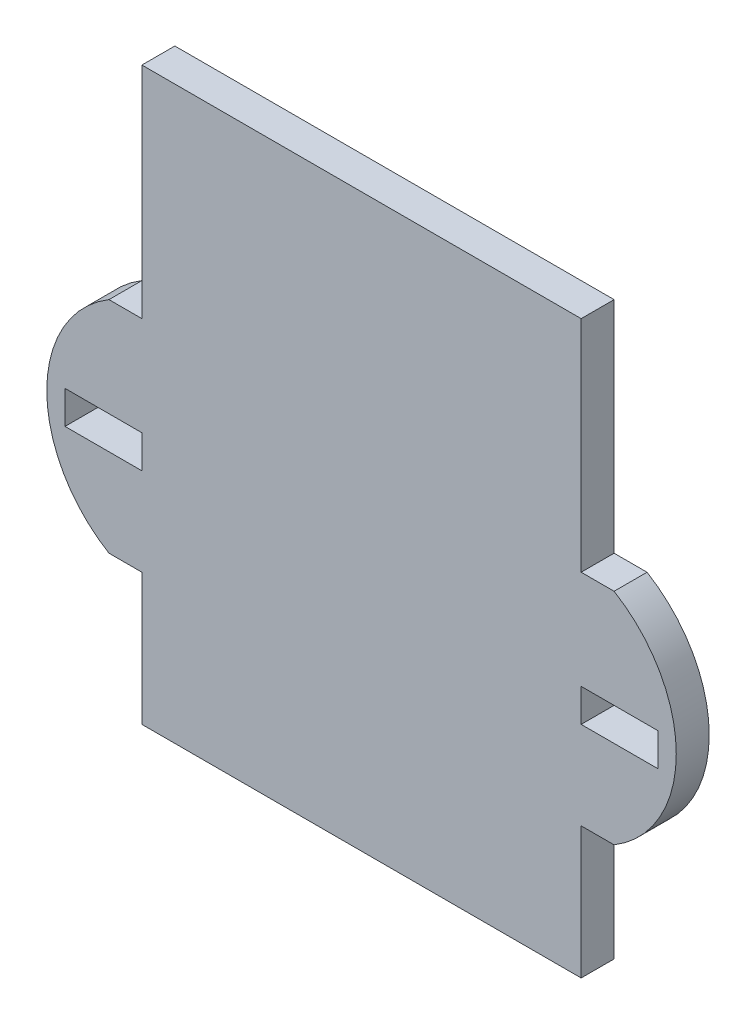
ISO-10303-21;
HEADER;
FILE_DESCRIPTION(('STEP AP214'),'2;1');
FILE_NAME('part.step','',(''),(''),'','','');
FILE_SCHEMA(('AUTOMOTIVE_DESIGN { 1 0 10303 214 1 1 1 1 }'));
ENDSEC;
DATA;
#1=APPLICATION_CONTEXT('core data for automotive mechanical design processes');
#2=APPLICATION_PROTOCOL_DEFINITION('international standard','automotive_design',2000,#1);
#3=PRODUCT_CONTEXT('',#1,'mechanical');
#4=PRODUCT('Part','Part','',(#3));
#5=PRODUCT_RELATED_PRODUCT_CATEGORY('part','',(#4));
#6=PRODUCT_DEFINITION_FORMATION('','',#4);
#7=PRODUCT_DEFINITION_CONTEXT('part definition',#1,'design');
#8=PRODUCT_DEFINITION('design','',#6,#7);
#9=PRODUCT_DEFINITION_SHAPE('','',#8);
#10=(LENGTH_UNIT() NAMED_UNIT(*) SI_UNIT(.MILLI.,.METRE.));
#11=(NAMED_UNIT(*) PLANE_ANGLE_UNIT() SI_UNIT($,.RADIAN.));
#12=(NAMED_UNIT(*) SI_UNIT($,.STERADIAN.) SOLID_ANGLE_UNIT());
#13=UNCERTAINTY_MEASURE_WITH_UNIT(LENGTH_MEASURE(1.E-05),#10,'distance_accuracy_value','');
#14=(GEOMETRIC_REPRESENTATION_CONTEXT(3) GLOBAL_UNCERTAINTY_ASSIGNED_CONTEXT((#13)) GLOBAL_UNIT_ASSIGNED_CONTEXT((#10,
#11,#12)) REPRESENTATION_CONTEXT('',''));
#15=CARTESIAN_POINT('',(0.,0.,0.));
#16=DIRECTION('',(0.,0.,1.));
#17=DIRECTION('',(1.,0.,0.));
#18=AXIS2_PLACEMENT_3D('',#15,#16,#17);
#19=CARTESIAN_POINT('',(-15.6140047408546,10.,3.));
#20=DIRECTION('',(0.,0.,-1.));
#21=DIRECTION('',(-1.,0.,0.));
#22=AXIS2_PLACEMENT_3D('',#19,#20,#21);
#23=PLANE('',#22);
#24=DIRECTION('',(0.,-1.,0.));
#25=VECTOR('',#24,1.);
#26=CARTESIAN_POINT('',(21.3859952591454,11.,3.));
#27=LINE('',#26,#25);
#28=CARTESIAN_POINT('',(21.3859952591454,11.,3.));
#29=VERTEX_POINT('',#28);
#30=CARTESIAN_POINT('',(21.3859952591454,8.00000000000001,3.));
#31=VERTEX_POINT('',#30);
#32=EDGE_CURVE('E206',#29,#31,#27,.T.);
#33=ORIENTED_EDGE('',*,*,#32,.F.);
#34=DIRECTION('',(-1.,0.,0.));
#35=VECTOR('',#34,1.);
#36=CARTESIAN_POINT('',(21.3859952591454,11.,3.));
#37=LINE('',#36,#35);
#38=CARTESIAN_POINT('',(28.3859952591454,11.,3.));
#39=VERTEX_POINT('',#38);
#40=EDGE_CURVE('E214',#39,#29,#37,.T.);
#41=ORIENTED_EDGE('',*,*,#40,.F.);
#42=DIRECTION('',(0.,1.,0.));
#43=VECTOR('',#42,1.);
#44=CARTESIAN_POINT('',(28.3859952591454,11.,3.));
#45=LINE('',#44,#43);
#46=CARTESIAN_POINT('',(28.3859952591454,8.00000000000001,3.));
#47=VERTEX_POINT('',#46);
#48=EDGE_CURVE('E211',#47,#39,#45,.T.);
#49=ORIENTED_EDGE('',*,*,#48,.F.);
#50=DIRECTION('',(1.,0.,0.));
#51=VECTOR('',#50,1.);
#52=CARTESIAN_POINT('',(21.3859952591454,8.00000000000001,3.));
#53=LINE('',#52,#51);
#54=EDGE_CURVE('E208',#31,#47,#53,.T.);
#55=ORIENTED_EDGE('',*,*,#54,.F.);
#56=EDGE_LOOP('',(#33,#41,#49,#55));
#57=FACE_BOUND('',#56,.T.);
#58=DIRECTION('',(0.,-1.,0.));
#59=VECTOR('',#58,1.);
#60=CARTESIAN_POINT('',(-18.6140047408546,40.,3.));
#61=LINE('',#60,#59);
#62=CARTESIAN_POINT('',(-18.6140047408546,40.,3.));
#63=VERTEX_POINT('',#62);
#64=CARTESIAN_POINT('',(-18.6140047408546,20.,3.));
#65=VERTEX_POINT('',#64);
#66=EDGE_CURVE('E237',#63,#65,#61,.T.);
#67=ORIENTED_EDGE('',*,*,#66,.T.);
#68=DIRECTION('',(-1.,0.,0.));
#69=VECTOR('',#68,1.);
#70=CARTESIAN_POINT('',(-21.6140047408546,20.,3.));
#71=LINE('',#70,#69);
#72=CARTESIAN_POINT('',(-21.6140047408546,20.,3.));
#73=VERTEX_POINT('',#72);
#74=EDGE_CURVE('E240',#65,#73,#71,.T.);
#75=ORIENTED_EDGE('',*,*,#74,.T.);
#76=CARTESIAN_POINT('',(-15.6140047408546,10.,3.));
#77=DIRECTION('',(0.,0.,1.));
#78=DIRECTION('',(-1.,0.,0.));
#79=AXIS2_PLACEMENT_3D('',#76,#77,#78);
#80=CIRCLE('',#79,11.6619037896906);
#81=CARTESIAN_POINT('',(-21.6140047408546,0.,3.));
#82=VERTEX_POINT('',#81);
#83=EDGE_CURVE('E243',#73,#82,#80,.T.);
#84=ORIENTED_EDGE('',*,*,#83,.T.);
#85=DIRECTION('',(1.,0.,0.));
#86=VECTOR('',#85,1.);
#87=CARTESIAN_POINT('',(-18.6140047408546,0.,3.));
#88=LINE('',#87,#86);
#89=CARTESIAN_POINT('',(-18.6140047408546,0.,3.));
#90=VERTEX_POINT('',#89);
#91=EDGE_CURVE('E245',#82,#90,#88,.T.);
#92=ORIENTED_EDGE('',*,*,#91,.T.);
#93=DIRECTION('',(0.,-1.,0.));
#94=VECTOR('',#93,1.);
#95=CARTESIAN_POINT('',(-18.6140047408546,0.,3.));
#96=LINE('',#95,#94);
#97=CARTESIAN_POINT('',(-18.6140047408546,-12.,3.));
#98=VERTEX_POINT('',#97);
#99=EDGE_CURVE('E247',#90,#98,#96,.T.);
#100=ORIENTED_EDGE('',*,*,#99,.T.);
#101=DIRECTION('',(1.,0.,0.));
#102=VECTOR('',#101,1.);
#103=CARTESIAN_POINT('',(-18.6140047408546,-12.,3.));
#104=LINE('',#103,#102);
#105=CARTESIAN_POINT('',(21.3859952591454,-12.,3.));
#106=VERTEX_POINT('',#105);
#107=EDGE_CURVE('E249',#98,#106,#104,.T.);
#108=ORIENTED_EDGE('',*,*,#107,.T.);
#109=DIRECTION('',(0.,1.,0.));
#110=VECTOR('',#109,1.);
#111=CARTESIAN_POINT('',(21.3859952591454,0.,3.));
#112=LINE('',#111,#110);
#113=CARTESIAN_POINT('',(21.3859952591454,0.,3.));
#114=VERTEX_POINT('',#113);
#115=EDGE_CURVE('E251',#106,#114,#112,.T.);
#116=ORIENTED_EDGE('',*,*,#115,.T.);
#117=DIRECTION('',(1.,0.,0.));
#118=VECTOR('',#117,1.);
#119=CARTESIAN_POINT('',(21.3859952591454,0.,3.));
#120=LINE('',#119,#118);
#121=CARTESIAN_POINT('',(24.3859952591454,0.,3.));
#122=VERTEX_POINT('',#121);
#123=EDGE_CURVE('E253',#114,#122,#120,.T.);
#124=ORIENTED_EDGE('',*,*,#123,.T.);
#125=CARTESIAN_POINT('',(18.3859952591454,10.,3.));
#126=DIRECTION('',(0.,0.,1.));
#127=DIRECTION('',(1.,0.,0.));
#128=AXIS2_PLACEMENT_3D('',#125,#126,#127);
#129=CIRCLE('',#128,11.6619037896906);
#130=CARTESIAN_POINT('',(24.3859952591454,20.,3.));
#131=VERTEX_POINT('',#130);
#132=EDGE_CURVE('E255',#122,#131,#129,.T.);
#133=ORIENTED_EDGE('',*,*,#132,.T.);
#134=DIRECTION('',(-1.,0.,0.));
#135=VECTOR('',#134,1.);
#136=CARTESIAN_POINT('',(24.3859952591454,20.,3.));
#137=LINE('',#136,#135);
#138=CARTESIAN_POINT('',(21.3859952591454,20.,3.));
#139=VERTEX_POINT('',#138);
#140=EDGE_CURVE('E257',#131,#139,#137,.T.);
#141=ORIENTED_EDGE('',*,*,#140,.T.);
#142=DIRECTION('',(0.,1.,0.));
#143=VECTOR('',#142,1.);
#144=CARTESIAN_POINT('',(21.3859952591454,40.,3.));
#145=LINE('',#144,#143);
#146=CARTESIAN_POINT('',(21.3859952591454,40.,3.));
#147=VERTEX_POINT('',#146);
#148=EDGE_CURVE('E259',#139,#147,#145,.T.);
#149=ORIENTED_EDGE('',*,*,#148,.T.);
#150=DIRECTION('',(-1.,0.,0.));
#151=VECTOR('',#150,1.);
#152=CARTESIAN_POINT('',(-18.6140047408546,40.,3.));
#153=LINE('',#152,#151);
#154=EDGE_CURVE('E261',#147,#63,#153,.T.);
#155=ORIENTED_EDGE('',*,*,#154,.T.);
#156=EDGE_LOOP('',(#67,#75,#84,#92,#100,#108,#116,#124,#133,#141,#149,#155));
#157=FACE_BOUND('',#156,.T.);
#158=DIRECTION('',(0.,1.,0.));
#159=VECTOR('',#158,1.);
#160=CARTESIAN_POINT('',(-18.6140047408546,11.,3.));
#161=LINE('',#160,#159);
#162=CARTESIAN_POINT('',(-18.6140047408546,8.00000000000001,3.));
#163=VERTEX_POINT('',#162);
#164=CARTESIAN_POINT('',(-18.6140047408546,11.,3.));
#165=VERTEX_POINT('',#164);
#166=EDGE_CURVE('E170',#163,#165,#161,.T.);
#167=ORIENTED_EDGE('',*,*,#166,.F.);
#168=DIRECTION('',(1.,0.,0.));
#169=VECTOR('',#168,1.);
#170=CARTESIAN_POINT('',(-18.6140047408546,8.00000000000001,3.));
#171=LINE('',#170,#169);
#172=CARTESIAN_POINT('',(-25.6140047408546,8.00000000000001,3.));
#173=VERTEX_POINT('',#172);
#174=EDGE_CURVE('E192',#173,#163,#171,.T.);
#175=ORIENTED_EDGE('',*,*,#174,.F.);
#176=DIRECTION('',(0.,-1.,0.));
#177=VECTOR('',#176,1.);
#178=CARTESIAN_POINT('',(-25.6140047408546,11.,3.));
#179=LINE('',#178,#177);
#180=CARTESIAN_POINT('',(-25.6140047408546,11.,3.));
#181=VERTEX_POINT('',#180);
#182=EDGE_CURVE('E190',#181,#173,#179,.T.);
#183=ORIENTED_EDGE('',*,*,#182,.F.);
#184=DIRECTION('',(-1.,0.,0.));
#185=VECTOR('',#184,1.);
#186=CARTESIAN_POINT('',(-18.6140047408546,11.,3.));
#187=LINE('',#186,#185);
#188=EDGE_CURVE('E178',#165,#181,#187,.T.);
#189=ORIENTED_EDGE('',*,*,#188,.F.);
#190=EDGE_LOOP('',(#167,#175,#183,#189));
#191=FACE_BOUND('',#190,.T.);
#192=ADVANCED_FACE('F33',(#57,#157,#191),#23,.F.);
#193=CARTESIAN_POINT('',(-15.6140047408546,10.,0.));
#194=DIRECTION('',(0.,0.,-1.));
#195=DIRECTION('',(-1.,0.,0.));
#196=AXIS2_PLACEMENT_3D('',#193,#194,#195);
#197=PLANE('',#196);
#198=DIRECTION('',(0.,-1.,0.));
#199=VECTOR('',#198,1.);
#200=CARTESIAN_POINT('',(-18.6140047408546,40.,0.));
#201=LINE('',#200,#199);
#202=CARTESIAN_POINT('',(-18.6140047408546,40.,0.));
#203=VERTEX_POINT('',#202);
#204=CARTESIAN_POINT('',(-18.6140047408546,20.,0.));
#205=VERTEX_POINT('',#204);
#206=EDGE_CURVE('E236',#203,#205,#201,.T.);
#207=ORIENTED_EDGE('',*,*,#206,.F.);
#208=DIRECTION('',(-1.,0.,0.));
#209=VECTOR('',#208,1.);
#210=CARTESIAN_POINT('',(-18.6140047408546,40.,0.));
#211=LINE('',#210,#209);
#212=CARTESIAN_POINT('',(21.3859952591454,40.,0.));
#213=VERTEX_POINT('',#212);
#214=EDGE_CURVE('E241',#213,#203,#211,.T.);
#215=ORIENTED_EDGE('',*,*,#214,.F.);
#216=DIRECTION('',(0.,1.,0.));
#217=VECTOR('',#216,1.);
#218=CARTESIAN_POINT('',(21.3859952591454,40.,0.));
#219=LINE('',#218,#217);
#220=CARTESIAN_POINT('',(21.3859952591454,20.,0.));
#221=VERTEX_POINT('',#220);
#222=EDGE_CURVE('E284',#221,#213,#219,.T.);
#223=ORIENTED_EDGE('',*,*,#222,.F.);
#224=DIRECTION('',(-1.,0.,0.));
#225=VECTOR('',#224,1.);
#226=CARTESIAN_POINT('',(24.3859952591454,20.,0.));
#227=LINE('',#226,#225);
#228=CARTESIAN_POINT('',(24.3859952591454,20.,0.));
#229=VERTEX_POINT('',#228);
#230=EDGE_CURVE('E282',#229,#221,#227,.T.);
#231=ORIENTED_EDGE('',*,*,#230,.F.);
#232=CARTESIAN_POINT('',(18.3859952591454,10.,0.));
#233=DIRECTION('',(0.,0.,1.));
#234=DIRECTION('',(1.,0.,0.));
#235=AXIS2_PLACEMENT_3D('',#232,#233,#234);
#236=CIRCLE('',#235,11.6619037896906);
#237=CARTESIAN_POINT('',(24.3859952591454,0.,0.));
#238=VERTEX_POINT('',#237);
#239=EDGE_CURVE('E280',#238,#229,#236,.T.);
#240=ORIENTED_EDGE('',*,*,#239,.F.);
#241=DIRECTION('',(1.,0.,0.));
#242=VECTOR('',#241,1.);
#243=CARTESIAN_POINT('',(21.3859952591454,0.,0.));
#244=LINE('',#243,#242);
#245=CARTESIAN_POINT('',(21.3859952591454,0.,0.));
#246=VERTEX_POINT('',#245);
#247=EDGE_CURVE('E278',#246,#238,#244,.T.);
#248=ORIENTED_EDGE('',*,*,#247,.F.);
#249=DIRECTION('',(0.,1.,0.));
#250=VECTOR('',#249,1.);
#251=CARTESIAN_POINT('',(21.3859952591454,0.,0.));
#252=LINE('',#251,#250);
#253=CARTESIAN_POINT('',(21.3859952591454,-12.,0.));
#254=VERTEX_POINT('',#253);
#255=EDGE_CURVE('E276',#254,#246,#252,.T.);
#256=ORIENTED_EDGE('',*,*,#255,.F.);
#257=DIRECTION('',(1.,0.,0.));
#258=VECTOR('',#257,1.);
#259=CARTESIAN_POINT('',(-18.6140047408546,-12.,0.));
#260=LINE('',#259,#258);
#261=CARTESIAN_POINT('',(-18.6140047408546,-12.,0.));
#262=VERTEX_POINT('',#261);
#263=EDGE_CURVE('E274',#262,#254,#260,.T.);
#264=ORIENTED_EDGE('',*,*,#263,.F.);
#265=DIRECTION('',(0.,-1.,0.));
#266=VECTOR('',#265,1.);
#267=CARTESIAN_POINT('',(-18.6140047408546,0.,0.));
#268=LINE('',#267,#266);
#269=CARTESIAN_POINT('',(-18.6140047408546,0.,0.));
#270=VERTEX_POINT('',#269);
#271=EDGE_CURVE('E272',#270,#262,#268,.T.);
#272=ORIENTED_EDGE('',*,*,#271,.F.);
#273=DIRECTION('',(1.,0.,0.));
#274=VECTOR('',#273,1.);
#275=CARTESIAN_POINT('',(-18.6140047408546,0.,0.));
#276=LINE('',#275,#274);
#277=CARTESIAN_POINT('',(-21.6140047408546,0.,0.));
#278=VERTEX_POINT('',#277);
#279=EDGE_CURVE('E270',#278,#270,#276,.T.);
#280=ORIENTED_EDGE('',*,*,#279,.F.);
#281=CARTESIAN_POINT('',(-15.6140047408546,10.,0.));
#282=DIRECTION('',(0.,0.,1.));
#283=DIRECTION('',(-1.,0.,0.));
#284=AXIS2_PLACEMENT_3D('',#281,#282,#283);
#285=CIRCLE('',#284,11.6619037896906);
#286=CARTESIAN_POINT('',(-21.6140047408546,20.,0.));
#287=VERTEX_POINT('',#286);
#288=EDGE_CURVE('E268',#287,#278,#285,.T.);
#289=ORIENTED_EDGE('',*,*,#288,.F.);
#290=DIRECTION('',(-1.,0.,0.));
#291=VECTOR('',#290,1.);
#292=CARTESIAN_POINT('',(-21.6140047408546,20.,0.));
#293=LINE('',#292,#291);
#294=EDGE_CURVE('E266',#205,#287,#293,.T.);
#295=ORIENTED_EDGE('',*,*,#294,.F.);
#296=EDGE_LOOP('',(#207,#215,#223,#231,#240,#248,#256,#264,#272,#280,#289,#295));
#297=FACE_BOUND('',#296,.T.);
#298=DIRECTION('',(-1.,0.,0.));
#299=VECTOR('',#298,1.);
#300=CARTESIAN_POINT('',(21.3859952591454,11.,0.));
#301=LINE('',#300,#299);
#302=CARTESIAN_POINT('',(28.3859952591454,11.,0.));
#303=VERTEX_POINT('',#302);
#304=CARTESIAN_POINT('',(21.3859952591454,11.,0.));
#305=VERTEX_POINT('',#304);
#306=EDGE_CURVE('E209',#303,#305,#301,.T.);
#307=ORIENTED_EDGE('',*,*,#306,.T.);
#308=DIRECTION('',(0.,-1.,0.));
#309=VECTOR('',#308,1.);
#310=CARTESIAN_POINT('',(21.3859952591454,11.,0.));
#311=LINE('',#310,#309);
#312=CARTESIAN_POINT('',(21.3859952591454,8.00000000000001,0.));
#313=VERTEX_POINT('',#312);
#314=EDGE_CURVE('E186',#305,#313,#311,.T.);
#315=ORIENTED_EDGE('',*,*,#314,.T.);
#316=DIRECTION('',(1.,0.,0.));
#317=VECTOR('',#316,1.);
#318=CARTESIAN_POINT('',(21.3859952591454,8.00000000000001,0.));
#319=LINE('',#318,#317);
#320=CARTESIAN_POINT('',(28.3859952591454,8.00000000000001,0.));
#321=VERTEX_POINT('',#320);
#322=EDGE_CURVE('E219',#313,#321,#319,.T.);
#323=ORIENTED_EDGE('',*,*,#322,.T.);
#324=DIRECTION('',(0.,1.,0.));
#325=VECTOR('',#324,1.);
#326=CARTESIAN_POINT('',(28.3859952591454,11.,0.));
#327=LINE('',#326,#325);
#328=EDGE_CURVE('E222',#321,#303,#327,.T.);
#329=ORIENTED_EDGE('',*,*,#328,.T.);
#330=EDGE_LOOP('',(#307,#315,#323,#329));
#331=FACE_BOUND('',#330,.T.);
#332=DIRECTION('',(1.,0.,0.));
#333=VECTOR('',#332,1.);
#334=CARTESIAN_POINT('',(-18.6140047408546,8.00000000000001,0.));
#335=LINE('',#334,#333);
#336=CARTESIAN_POINT('',(-25.6140047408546,8.00000000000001,0.));
#337=VERTEX_POINT('',#336);
#338=CARTESIAN_POINT('',(-18.6140047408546,8.,0.));
#339=VERTEX_POINT('',#338);
#340=EDGE_CURVE('E179',#337,#339,#335,.T.);
#341=ORIENTED_EDGE('',*,*,#340,.T.);
#342=DIRECTION('',(0.,1.,0.));
#343=VECTOR('',#342,1.);
#344=CARTESIAN_POINT('',(-18.6140047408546,11.,0.));
#345=LINE('',#344,#343);
#346=CARTESIAN_POINT('',(-18.6140047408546,11.,0.));
#347=VERTEX_POINT('',#346);
#348=EDGE_CURVE('E56',#339,#347,#345,.T.);
#349=ORIENTED_EDGE('',*,*,#348,.T.);
#350=DIRECTION('',(-1.,0.,0.));
#351=VECTOR('',#350,1.);
#352=CARTESIAN_POINT('',(-18.6140047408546,11.,0.));
#353=LINE('',#352,#351);
#354=CARTESIAN_POINT('',(-25.6140047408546,11.,0.));
#355=VERTEX_POINT('',#354);
#356=EDGE_CURVE('E185',#347,#355,#353,.T.);
#357=ORIENTED_EDGE('',*,*,#356,.T.);
#358=DIRECTION('',(0.,-1.,0.));
#359=VECTOR('',#358,1.);
#360=CARTESIAN_POINT('',(-25.6140047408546,11.,0.));
#361=LINE('',#360,#359);
#362=EDGE_CURVE('E198',#355,#337,#361,.T.);
#363=ORIENTED_EDGE('',*,*,#362,.T.);
#364=EDGE_LOOP('',(#341,#349,#357,#363));
#365=FACE_BOUND('',#364,.T.);
#366=ADVANCED_FACE('F326',(#297,#331,#365),#197,.T.);
#367=CARTESIAN_POINT('',(-18.6140047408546,40.,3.));
#368=DIRECTION('',(1.,0.,0.));
#369=DIRECTION('',(0.,0.,-1.));
#370=AXIS2_PLACEMENT_3D('',#367,#368,#369);
#371=PLANE('',#370);
#372=ORIENTED_EDGE('',*,*,#206,.T.);
#373=DIRECTION('',(0.,0.,-1.));
#374=VECTOR('',#373,1.);
#375=CARTESIAN_POINT('',(-18.6140047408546,20.,3.));
#376=LINE('',#375,#374);
#377=EDGE_CURVE('E11',#65,#205,#376,.T.);
#378=ORIENTED_EDGE('',*,*,#377,.F.);
#379=ORIENTED_EDGE('',*,*,#66,.F.);
#380=DIRECTION('',(0.,0.,-1.));
#381=VECTOR('',#380,1.);
#382=CARTESIAN_POINT('',(-18.6140047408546,40.,3.));
#383=LINE('',#382,#381);
#384=EDGE_CURVE('E263',#63,#203,#383,.T.);
#385=ORIENTED_EDGE('',*,*,#384,.T.);
#386=EDGE_LOOP('',(#372,#378,#379,#385));
#387=FACE_BOUND('',#386,.T.);
#388=ADVANCED_FACE('F35',(#387),#371,.F.);
#389=CARTESIAN_POINT('',(-21.6140047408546,20.,3.));
#390=DIRECTION('',(0.,-1.,0.));
#391=DIRECTION('',(0.,0.,-1.));
#392=AXIS2_PLACEMENT_3D('',#389,#390,#391);
#393=PLANE('',#392);
#394=ORIENTED_EDGE('',*,*,#294,.T.);
#395=DIRECTION('',(0.,0.,-1.));
#396=VECTOR('',#395,1.);
#397=CARTESIAN_POINT('',(-21.6140047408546,20.,3.));
#398=LINE('',#397,#396);
#399=EDGE_CURVE('E41',#73,#287,#398,.T.);
#400=ORIENTED_EDGE('',*,*,#399,.F.);
#401=ORIENTED_EDGE('',*,*,#74,.F.);
#402=ORIENTED_EDGE('',*,*,#377,.T.);
#403=EDGE_LOOP('',(#394,#400,#401,#402));
#404=FACE_BOUND('',#403,.T.);
#405=ADVANCED_FACE('F343',(#404),#393,.F.);
#406=CARTESIAN_POINT('',(-15.6140047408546,10.,3.));
#407=DIRECTION('',(0.,0.,-1.));
#408=DIRECTION('',(-1.,0.,0.));
#409=AXIS2_PLACEMENT_3D('',#406,#407,#408);
#410=CYLINDRICAL_SURFACE('',#409,11.6619037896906);
#411=ORIENTED_EDGE('',*,*,#288,.T.);
#412=DIRECTION('',(0.,0.,-1.));
#413=VECTOR('',#412,1.);
#414=CARTESIAN_POINT('',(-21.6140047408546,0.,3.));
#415=LINE('',#414,#413);
#416=EDGE_CURVE('E313',#82,#278,#415,.T.);
#417=ORIENTED_EDGE('',*,*,#416,.F.);
#418=ORIENTED_EDGE('',*,*,#83,.F.);
#419=ORIENTED_EDGE('',*,*,#399,.T.);
#420=EDGE_LOOP('',(#411,#417,#418,#419));
#421=FACE_BOUND('',#420,.T.);
#422=ADVANCED_FACE('F320',(#421),#410,.T.);
#423=CARTESIAN_POINT('',(-18.6140047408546,0.,3.));
#424=DIRECTION('',(0.,1.,0.));
#425=DIRECTION('',(-1.,0.,0.));
#426=AXIS2_PLACEMENT_3D('',#423,#424,#425);
#427=PLANE('',#426);
#428=ORIENTED_EDGE('',*,*,#279,.T.);
#429=DIRECTION('',(0.,0.,-1.));
#430=VECTOR('',#429,1.);
#431=CARTESIAN_POINT('',(-18.6140047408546,0.,3.));
#432=LINE('',#431,#430);
#433=EDGE_CURVE('E310',#90,#270,#432,.T.);
#434=ORIENTED_EDGE('',*,*,#433,.F.);
#435=ORIENTED_EDGE('',*,*,#91,.F.);
#436=ORIENTED_EDGE('',*,*,#416,.T.);
#437=EDGE_LOOP('',(#428,#434,#435,#436));
#438=FACE_BOUND('',#437,.T.);
#439=ADVANCED_FACE('F332',(#438),#427,.F.);
#440=CARTESIAN_POINT('',(-18.6140047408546,0.,3.));
#441=DIRECTION('',(1.,0.,0.));
#442=DIRECTION('',(0.,1.,0.));
#443=AXIS2_PLACEMENT_3D('',#440,#441,#442);
#444=PLANE('',#443);
#445=ORIENTED_EDGE('',*,*,#271,.T.);
#446=DIRECTION('',(0.,0.,-1.));
#447=VECTOR('',#446,1.);
#448=CARTESIAN_POINT('',(-18.6140047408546,-12.,3.));
#449=LINE('',#448,#447);
#450=EDGE_CURVE('E307',#98,#262,#449,.T.);
#451=ORIENTED_EDGE('',*,*,#450,.F.);
#452=ORIENTED_EDGE('',*,*,#99,.F.);
#453=ORIENTED_EDGE('',*,*,#433,.T.);
#454=EDGE_LOOP('',(#445,#451,#452,#453));
#455=FACE_BOUND('',#454,.T.);
#456=ADVANCED_FACE('F336',(#455),#444,.F.);
#457=CARTESIAN_POINT('',(-18.6140047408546,-12.,3.));
#458=DIRECTION('',(0.,1.,0.));
#459=DIRECTION('',(-1.,0.,0.));
#460=AXIS2_PLACEMENT_3D('',#457,#458,#459);
#461=PLANE('',#460);
#462=ORIENTED_EDGE('',*,*,#263,.T.);
#463=DIRECTION('',(0.,0.,-1.));
#464=VECTOR('',#463,1.);
#465=CARTESIAN_POINT('',(21.3859952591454,-12.,3.));
#466=LINE('',#465,#464);
#467=EDGE_CURVE('E304',#106,#254,#466,.T.);
#468=ORIENTED_EDGE('',*,*,#467,.F.);
#469=ORIENTED_EDGE('',*,*,#107,.F.);
#470=ORIENTED_EDGE('',*,*,#450,.T.);
#471=EDGE_LOOP('',(#462,#468,#469,#470));
#472=FACE_BOUND('',#471,.T.);
#473=ADVANCED_FACE('F376',(#472),#461,.F.);
#474=CARTESIAN_POINT('',(21.3859952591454,0.,3.));
#475=DIRECTION('',(-1.,0.,0.));
#476=DIRECTION('',(0.,-1.,0.));
#477=AXIS2_PLACEMENT_3D('',#474,#475,#476);
#478=PLANE('',#477);
#479=ORIENTED_EDGE('',*,*,#255,.T.);
#480=DIRECTION('',(0.,0.,-1.));
#481=VECTOR('',#480,1.);
#482=CARTESIAN_POINT('',(21.3859952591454,0.,3.));
#483=LINE('',#482,#481);
#484=EDGE_CURVE('E301',#114,#246,#483,.T.);
#485=ORIENTED_EDGE('',*,*,#484,.F.);
#486=ORIENTED_EDGE('',*,*,#115,.F.);
#487=ORIENTED_EDGE('',*,*,#467,.T.);
#488=EDGE_LOOP('',(#479,#485,#486,#487));
#489=FACE_BOUND('',#488,.T.);
#490=ADVANCED_FACE('F374',(#489),#478,.F.);
#491=CARTESIAN_POINT('',(21.3859952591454,0.,3.));
#492=DIRECTION('',(0.,1.,0.));
#493=DIRECTION('',(-1.,0.,0.));
#494=AXIS2_PLACEMENT_3D('',#491,#492,#493);
#495=PLANE('',#494);
#496=ORIENTED_EDGE('',*,*,#247,.T.);
#497=DIRECTION('',(0.,0.,-1.));
#498=VECTOR('',#497,1.);
#499=CARTESIAN_POINT('',(24.3859952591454,0.,3.));
#500=LINE('',#499,#498);
#501=EDGE_CURVE('E298',#122,#238,#500,.T.);
#502=ORIENTED_EDGE('',*,*,#501,.F.);
#503=ORIENTED_EDGE('',*,*,#123,.F.);
#504=ORIENTED_EDGE('',*,*,#484,.T.);
#505=EDGE_LOOP('',(#496,#502,#503,#504));
#506=FACE_BOUND('',#505,.T.);
#507=ADVANCED_FACE('F370',(#506),#495,.F.);
#508=CARTESIAN_POINT('',(18.3859952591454,10.,3.));
#509=DIRECTION('',(0.,0.,-1.));
#510=DIRECTION('',(-1.,0.,0.));
#511=AXIS2_PLACEMENT_3D('',#508,#509,#510);
#512=CYLINDRICAL_SURFACE('',#511,11.6619037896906);
#513=ORIENTED_EDGE('',*,*,#239,.T.);
#514=DIRECTION('',(0.,0.,-1.));
#515=VECTOR('',#514,1.);
#516=CARTESIAN_POINT('',(24.3859952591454,20.,3.));
#517=LINE('',#516,#515);
#518=EDGE_CURVE('E295',#131,#229,#517,.T.);
#519=ORIENTED_EDGE('',*,*,#518,.F.);
#520=ORIENTED_EDGE('',*,*,#132,.F.);
#521=ORIENTED_EDGE('',*,*,#501,.T.);
#522=EDGE_LOOP('',(#513,#519,#520,#521));
#523=FACE_BOUND('',#522,.T.);
#524=ADVANCED_FACE('F365',(#523),#512,.T.);
#525=CARTESIAN_POINT('',(24.3859952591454,20.,3.));
#526=DIRECTION('',(0.,-1.,0.));
#527=DIRECTION('',(0.,0.,-1.));
#528=AXIS2_PLACEMENT_3D('',#525,#526,#527);
#529=PLANE('',#528);
#530=ORIENTED_EDGE('',*,*,#230,.T.);
#531=DIRECTION('',(0.,0.,-1.));
#532=VECTOR('',#531,1.);
#533=CARTESIAN_POINT('',(21.3859952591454,20.,3.));
#534=LINE('',#533,#532);
#535=EDGE_CURVE('E292',#139,#221,#534,.T.);
#536=ORIENTED_EDGE('',*,*,#535,.F.);
#537=ORIENTED_EDGE('',*,*,#140,.F.);
#538=ORIENTED_EDGE('',*,*,#518,.T.);
#539=EDGE_LOOP('',(#530,#536,#537,#538));
#540=FACE_BOUND('',#539,.T.);
#541=ADVANCED_FACE('F359',(#540),#529,.F.);
#542=CARTESIAN_POINT('',(21.3859952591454,40.,3.));
#543=DIRECTION('',(-1.,0.,0.));
#544=DIRECTION('',(0.,-1.,0.));
#545=AXIS2_PLACEMENT_3D('',#542,#543,#544);
#546=PLANE('',#545);
#547=ORIENTED_EDGE('',*,*,#222,.T.);
#548=DIRECTION('',(0.,0.,-1.));
#549=VECTOR('',#548,1.);
#550=CARTESIAN_POINT('',(21.3859952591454,40.,3.));
#551=LINE('',#550,#549);
#552=EDGE_CURVE('E289',#147,#213,#551,.T.);
#553=ORIENTED_EDGE('',*,*,#552,.F.);
#554=ORIENTED_EDGE('',*,*,#148,.F.);
#555=ORIENTED_EDGE('',*,*,#535,.T.);
#556=EDGE_LOOP('',(#547,#553,#554,#555));
#557=FACE_BOUND('',#556,.T.);
#558=ADVANCED_FACE('F355',(#557),#546,.F.);
#559=CARTESIAN_POINT('',(-18.6140047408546,40.,3.));
#560=DIRECTION('',(0.,-1.,0.));
#561=DIRECTION('',(0.,0.,-1.));
#562=AXIS2_PLACEMENT_3D('',#559,#560,#561);
#563=PLANE('',#562);
#564=ORIENTED_EDGE('',*,*,#214,.T.);
#565=ORIENTED_EDGE('',*,*,#384,.F.);
#566=ORIENTED_EDGE('',*,*,#154,.F.);
#567=ORIENTED_EDGE('',*,*,#552,.T.);
#568=EDGE_LOOP('',(#564,#565,#566,#567));
#569=FACE_BOUND('',#568,.T.);
#570=ADVANCED_FACE('F350',(#569),#563,.F.);
#571=CARTESIAN_POINT('',(21.3859952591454,11.,3.));
#572=DIRECTION('',(1.,0.,0.));
#573=DIRECTION('',(0.,1.,0.));
#574=AXIS2_PLACEMENT_3D('',#571,#572,#573);
#575=PLANE('',#574);
#576=ORIENTED_EDGE('',*,*,#314,.F.);
#577=DIRECTION('',(0.,0.,-1.));
#578=VECTOR('',#577,1.);
#579=CARTESIAN_POINT('',(21.3859952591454,11.,3.));
#580=LINE('',#579,#578);
#581=EDGE_CURVE('E216',#29,#305,#580,.T.);
#582=ORIENTED_EDGE('',*,*,#581,.F.);
#583=ORIENTED_EDGE('',*,*,#32,.T.);
#584=DIRECTION('',(0.,0.,-1.));
#585=VECTOR('',#584,1.);
#586=CARTESIAN_POINT('',(21.3859952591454,8.00000000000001,3.));
#587=LINE('',#586,#585);
#588=EDGE_CURVE('E233',#31,#313,#587,.T.);
#589=ORIENTED_EDGE('',*,*,#588,.T.);
#590=EDGE_LOOP('',(#576,#582,#583,#589));
#591=FACE_BOUND('',#590,.T.);
#592=ADVANCED_FACE('F394',(#591),#575,.T.);
#593=CARTESIAN_POINT('',(21.3859952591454,8.00000000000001,3.));
#594=DIRECTION('',(0.,1.,0.));
#595=DIRECTION('',(-1.,0.,0.));
#596=AXIS2_PLACEMENT_3D('',#593,#594,#595);
#597=PLANE('',#596);
#598=ORIENTED_EDGE('',*,*,#322,.F.);
#599=ORIENTED_EDGE('',*,*,#588,.F.);
#600=ORIENTED_EDGE('',*,*,#54,.T.);
#601=DIRECTION('',(0.,0.,-1.));
#602=VECTOR('',#601,1.);
#603=CARTESIAN_POINT('',(28.3859952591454,8.00000000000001,3.));
#604=LINE('',#603,#602);
#605=EDGE_CURVE('E231',#47,#321,#604,.T.);
#606=ORIENTED_EDGE('',*,*,#605,.T.);
#607=EDGE_LOOP('',(#598,#599,#600,#606));
#608=FACE_BOUND('',#607,.T.);
#609=ADVANCED_FACE('F432',(#608),#597,.T.);
#610=CARTESIAN_POINT('',(28.3859952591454,11.,3.));
#611=DIRECTION('',(-1.,0.,0.));
#612=DIRECTION('',(0.,-1.,0.));
#613=AXIS2_PLACEMENT_3D('',#610,#611,#612);
#614=PLANE('',#613);
#615=ORIENTED_EDGE('',*,*,#328,.F.);
#616=ORIENTED_EDGE('',*,*,#605,.F.);
#617=ORIENTED_EDGE('',*,*,#48,.T.);
#618=DIRECTION('',(0.,0.,-1.));
#619=VECTOR('',#618,1.);
#620=CARTESIAN_POINT('',(28.3859952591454,11.,3.));
#621=LINE('',#620,#619);
#622=EDGE_CURVE('E229',#39,#303,#621,.T.);
#623=ORIENTED_EDGE('',*,*,#622,.T.);
#624=EDGE_LOOP('',(#615,#616,#617,#623));
#625=FACE_BOUND('',#624,.T.);
#626=ADVANCED_FACE('F439',(#625),#614,.T.);
#627=CARTESIAN_POINT('',(21.3859952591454,11.,3.));
#628=DIRECTION('',(0.,-1.,0.));
#629=DIRECTION('',(0.,0.,-1.));
#630=AXIS2_PLACEMENT_3D('',#627,#628,#629);
#631=PLANE('',#630);
#632=ORIENTED_EDGE('',*,*,#306,.F.);
#633=ORIENTED_EDGE('',*,*,#622,.F.);
#634=ORIENTED_EDGE('',*,*,#40,.T.);
#635=ORIENTED_EDGE('',*,*,#581,.T.);
#636=EDGE_LOOP('',(#632,#633,#634,#635));
#637=FACE_BOUND('',#636,.T.);
#638=ADVANCED_FACE('F446',(#637),#631,.T.);
#639=CARTESIAN_POINT('',(-18.6140047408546,11.,3.));
#640=DIRECTION('',(-1.,0.,0.));
#641=DIRECTION('',(0.,-1.,0.));
#642=AXIS2_PLACEMENT_3D('',#639,#640,#641);
#643=PLANE('',#642);
#644=ORIENTED_EDGE('',*,*,#348,.F.);
#645=DIRECTION('',(0.,0.,-1.));
#646=VECTOR('',#645,1.);
#647=CARTESIAN_POINT('',(-18.6140047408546,8.00000000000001,3.));
#648=LINE('',#647,#646);
#649=EDGE_CURVE('E174',#163,#339,#648,.T.);
#650=ORIENTED_EDGE('',*,*,#649,.F.);
#651=ORIENTED_EDGE('',*,*,#166,.T.);
#652=DIRECTION('',(0.,0.,-1.));
#653=VECTOR('',#652,1.);
#654=CARTESIAN_POINT('',(-18.6140047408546,11.,3.));
#655=LINE('',#654,#653);
#656=EDGE_CURVE('E173',#165,#347,#655,.T.);
#657=ORIENTED_EDGE('',*,*,#656,.T.);
#658=EDGE_LOOP('',(#644,#650,#651,#657));
#659=FACE_BOUND('',#658,.T.);
#660=ADVANCED_FACE('F172',(#659),#643,.T.);
#661=CARTESIAN_POINT('',(-18.6140047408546,11.,3.));
#662=DIRECTION('',(0.,-1.,0.));
#663=DIRECTION('',(0.,0.,-1.));
#664=AXIS2_PLACEMENT_3D('',#661,#662,#663);
#665=PLANE('',#664);
#666=ORIENTED_EDGE('',*,*,#356,.F.);
#667=ORIENTED_EDGE('',*,*,#656,.F.);
#668=ORIENTED_EDGE('',*,*,#188,.T.);
#669=DIRECTION('',(0.,0.,-1.));
#670=VECTOR('',#669,1.);
#671=CARTESIAN_POINT('',(-25.6140047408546,11.,3.));
#672=LINE('',#671,#670);
#673=EDGE_CURVE('E187',#181,#355,#672,.T.);
#674=ORIENTED_EDGE('',*,*,#673,.T.);
#675=EDGE_LOOP('',(#666,#667,#668,#674));
#676=FACE_BOUND('',#675,.T.);
#677=ADVANCED_FACE('F182',(#676),#665,.T.);
#678=CARTESIAN_POINT('',(-25.6140047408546,11.,3.));
#679=DIRECTION('',(1.,0.,0.));
#680=DIRECTION('',(0.,1.,0.));
#681=AXIS2_PLACEMENT_3D('',#678,#679,#680);
#682=PLANE('',#681);
#683=ORIENTED_EDGE('',*,*,#362,.F.);
#684=ORIENTED_EDGE('',*,*,#673,.F.);
#685=ORIENTED_EDGE('',*,*,#182,.T.);
#686=DIRECTION('',(0.,0.,-1.));
#687=VECTOR('',#686,1.);
#688=CARTESIAN_POINT('',(-25.6140047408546,8.00000000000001,3.));
#689=LINE('',#688,#687);
#690=EDGE_CURVE('E48',#173,#337,#689,.T.);
#691=ORIENTED_EDGE('',*,*,#690,.T.);
#692=EDGE_LOOP('',(#683,#684,#685,#691));
#693=FACE_BOUND('',#692,.T.);
#694=ADVANCED_FACE('F467',(#693),#682,.T.);
#695=CARTESIAN_POINT('',(-18.6140047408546,8.00000000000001,3.));
#696=DIRECTION('',(0.,1.,0.));
#697=DIRECTION('',(-1.,0.,0.));
#698=AXIS2_PLACEMENT_3D('',#695,#696,#697);
#699=PLANE('',#698);
#700=ORIENTED_EDGE('',*,*,#340,.F.);
#701=ORIENTED_EDGE('',*,*,#690,.F.);
#702=ORIENTED_EDGE('',*,*,#174,.T.);
#703=ORIENTED_EDGE('',*,*,#649,.T.);
#704=EDGE_LOOP('',(#700,#701,#702,#703));
#705=FACE_BOUND('',#704,.T.);
#706=ADVANCED_FACE('F474',(#705),#699,.T.);
#707=CLOSED_SHELL('',(#192,#366,#388,#405,#422,#439,#456,#473,#490,#507,#524,#541,#558,#570,
#592,#609,#626,#638,#660,#677,#694,#706));
#708=MANIFOLD_SOLID_BREP('B2',#707);
#709=ADVANCED_BREP_SHAPE_REPRESENTATION('',(#18,#708),#14);
#710=SHAPE_DEFINITION_REPRESENTATION(#9,#709);
ENDSEC;
END-ISO-10303-21;
